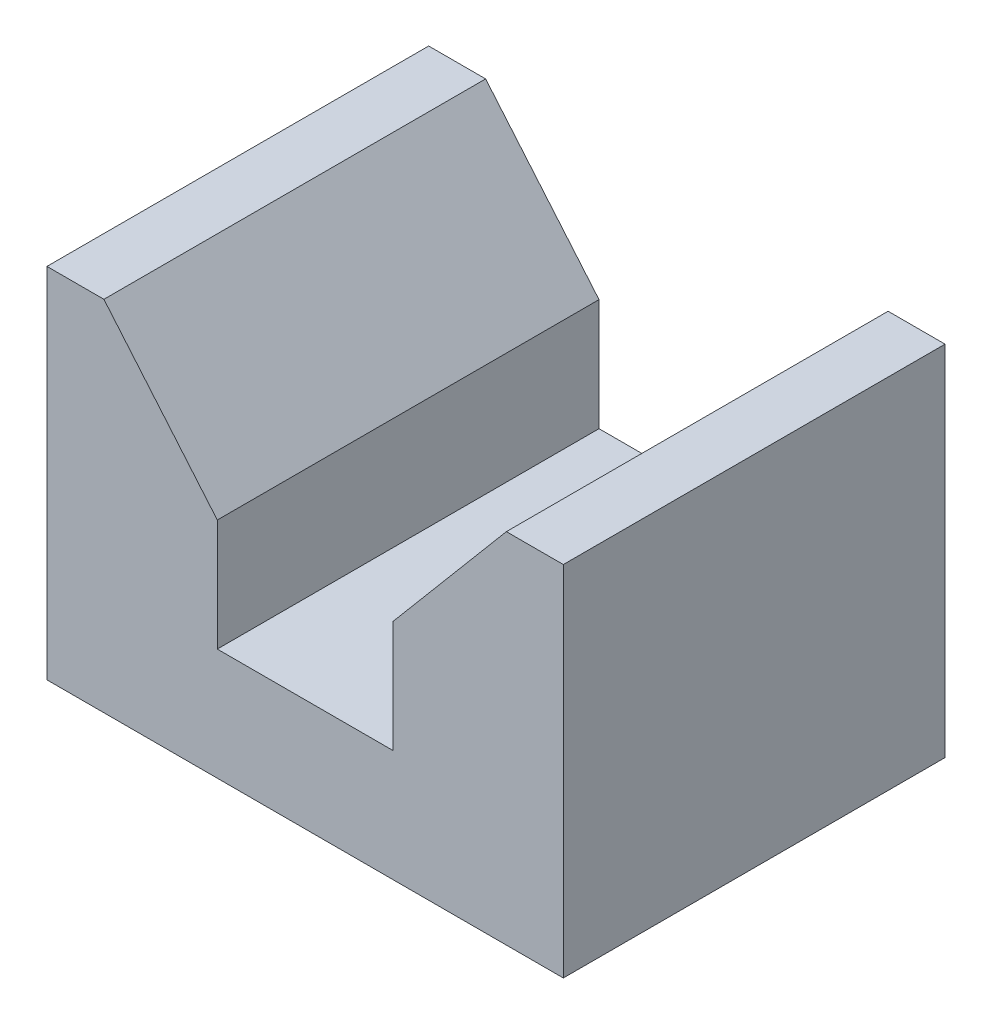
from build123d import *

# Parameters (mm, degrees)
EXTRUDE1_DEPTH = 30


with BuildPart() as part:
    # Sketch1 → Extrude1 (new, symmetric)
    with BuildSketch(Plane.XY):
        Polygon((40.582195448, 0), (-40.582195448, 0), (-40.582195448, 56.283128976), (-31.628333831, 56.283128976), (-13.806699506, 35.146931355), (-13.806699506, 17.579494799), (13.806699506, 17.579494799), (13.806699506, 35.146931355), (31.628333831, 56.283128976), (40.582195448, 56.283128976), align=None)
    extrude(amount=EXTRUDE1_DEPTH, both=True)


solid = part.part
